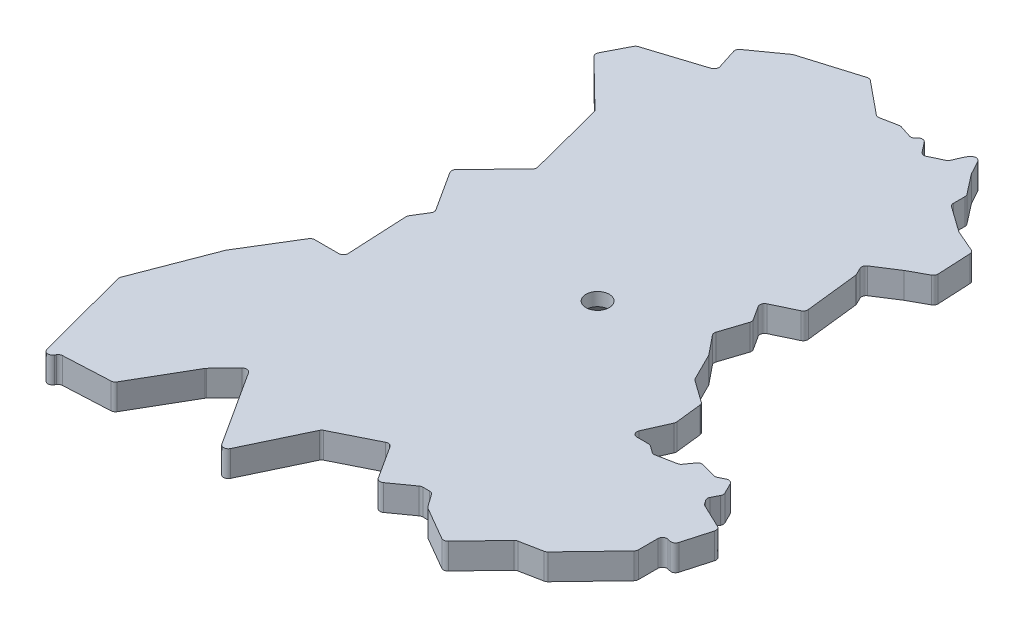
from build123d import *

# Parameters (mm, degrees)
BOSS_EXTRU_1_DEPTH                             = 5
CONG_1_R                                       = 0.9
FRAISAGE_POUR_VIS_T_TE_FRAIS_E_M41_D           = 4.5
FRAISAGE_POUR_VIS_T_TE_FRAIS_E_M41_CSINK_D     = 9.4
FRAISAGE_POUR_VIS_T_TE_FRAIS_E_M41_CSINK_ANGLE = 90


with BuildPart() as part:
    # Esquisse1 → Boss.-Extru.1 (new body)
    with BuildSketch(Plane(origin=(0, 0, 0), x_dir=(1, 0, 0), z_dir=(0, 1, 0))):
        Polygon((-10.941540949, 63.595080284), (-3.869711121, 57.820477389), (-1.4e-08, 58.580973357), (3.103081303, 57.567229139), (4.306471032, 59.040952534), (6.916683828, 55.681362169), (10.434006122, 57.36116315), (11.446720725, 59.704243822), (12.735497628, 61.282536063), (14.886637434, 57.361157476), (18.042910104, 53.298736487), (18.042910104, 50.268036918), (23.371023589, 46.477061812), (28.063351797, 44.448967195), (28.436769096, 36.88064725), (24.512113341, 34.727709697), (19.570725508, 31.543548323), (20.629835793, 29.32588548), (21.877892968, 18.292312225), (15.903639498, 15.43913131), (18.412210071, 11.546169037), (16.51950147, 5.752568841), (19.827055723, 1.662517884), (22.53475173, -3.766878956), (27.282822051, -7.145150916), (27.925841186, -12.829825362), (25.204278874, -18.989519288), (29.120202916, -18.989519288), (30.963004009, -20.30068), (35.327090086, -19.443026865), (37.026597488, -17.05441495), (40.777967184, -18.11659875), (43.038681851, -16.98915711), (44.666712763, -20.253639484), (43.511092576, -22.49265868), (44.463228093, -23.826183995), (50.011893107, -26.467164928), (48.043189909, -33.420136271), (45.60437309, -32.805860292), (45.60437309, -38.073751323), (37.026597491, -47.018586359), (32.201713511, -47.96679792), (25.300087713, -55.163757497), (18.173278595, -51.030962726), (16.053748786, -48.062428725), (13.982492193, -48.062428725), (8.966137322, -51.644100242), (3.901886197, -43.785067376), (-5.100561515, -48.274680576), (-11.471029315, -61.658946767), (-22.343400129, -44.786497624), (-26.600291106, -49.140124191), (-33.13222156, -60.404129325), (-43.079791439, -60.894937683), (-44.557952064, -63.443955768), (-50.161231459, -42.371676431), (-44.434407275, -27.444308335), (-38.106006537, -17.083630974), (-32.000560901, -17.083630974), (-32.636404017, -4.19653616), (-30.585474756, -0.838813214), (-36.172036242, 7.830774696), (-28.059737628, 16.127420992), (-32.047740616, 31.54354832), (-41.759480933, 41.039498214), (-38.989462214, 46.406421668), (-27.123913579, 50.193310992), (-28.828445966, 55.534162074), (-22.391334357, 60.130252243), align=None)
    extrude(amount=BOSS_EXTRU_1_DEPTH)

    # Cong_1
    cong_1_edges = [part.edges().sort_by_distance(p)[0] for p in [
        (48.043189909, 2.5, 33.420136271),
        (45.60437309, 2.5, 32.805860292),
        (45.60437309, 2.5, 38.073751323),
        (37.026597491, 2.5, 47.018586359),
        (32.201713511, 2.5, 47.96679792),
        (25.300087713, 2.5, 55.163757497),
        (18.173278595, 2.5, 51.030962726),
        (16.053748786, 2.5, 48.062428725),
        (13.982492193, 2.5, 48.062428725),
        (8.966137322, 2.5, 51.644100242),
        (3.901886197, 2.5, 43.785067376),
        (-5.100561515, 2.5, 48.274680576),
        (-11.471029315, 2.5, 61.658946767),
        (-22.343400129, 2.5, 44.786497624),
        (-26.600291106, 2.5, 49.140124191),
        (-33.13222156, 2.5, 60.404129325),
        (-43.079791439, 2.5, 60.894937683),
        (-44.557952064, 2.5, 63.443955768),
        (-50.161231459, 2.5, 42.371676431),
        (-44.434407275, 2.5, 27.444308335),
        (-38.106006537, 2.5, 17.083630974),
        (-32.000560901, 2.5, 17.083630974),
        (-32.636404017, 2.5, 4.19653616),
        (-30.585474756, 2.5, 0.838813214),
        (-36.172036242, 2.5, -7.830774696),
        (-28.059737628, 2.5, -16.127420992),
        (-32.047740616, 2.5, -31.54354832),
        (-41.759480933, 2.5, -41.039498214),
        (-38.989462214, 2.5, -46.406421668),
        (-27.123913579, 2.5, -50.193310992),
        (-28.828445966, 2.5, -55.534162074),
        (-22.391334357, 2.5, -60.130252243),
        (-10.941540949, 2.5, -63.595080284),
        (-3.869711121, 2.5, -57.820477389),
        (-1.4e-08, 2.5, -58.580973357),
        (3.103081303, 2.5, -57.567229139),
        (4.306471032, 2.5, -59.040952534),
        (6.916683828, 2.5, -55.681362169),
        (10.434006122, 2.5, -57.36116315),
        (11.446720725, 2.5, -59.704243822),
        (12.735497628, 2.5, -61.282536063),
        (14.886637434, 2.5, -57.361157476),
        (18.042910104, 2.5, -53.298736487),
        (18.042910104, 2.5, -50.268036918),
        (23.371023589, 2.5, -46.477061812),
        (28.063351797, 2.5, -44.448967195),
        (28.436769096, 2.5, -36.88064725),
        (19.570725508, 2.5, -31.543548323),
        (20.629835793, 2.5, -29.32588548),
        (21.877892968, 2.5, -18.292312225),
        (15.903639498, 2.5, -15.43913131),
        (18.412210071, 2.5, -11.546169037),
        (16.51950147, 2.5, -5.752568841),
        (19.827055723, 2.5, -1.662517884),
        (22.53475173, 2.5, 3.766878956),
        (27.282822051, 2.5, 7.145150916),
        (27.925841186, 2.5, 12.829825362),
        (25.204278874, 2.5, 18.989519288),
        (29.120202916, 2.5, 18.989519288),
        (30.963004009, 2.5, 20.30068),
        (35.327090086, 2.5, 19.443026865),
        (37.026597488, 2.5, 17.05441495),
        (40.777967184, 2.5, 18.11659875),
        (43.038681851, 2.5, 16.98915711),
        (44.666712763, 2.5, 20.253639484),
        (43.511092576, 2.5, 22.49265868),
        (44.463228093, 2.5, 23.826183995),
        (50.011893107, 2.5, 26.467164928),
    ]]
    fillet(cong_1_edges, radius=CONG_1_R)

    # Fraisage pour vis _ t_te frais_e M41 (through all)
    with Locations(Plane(origin=(0, 0, 0), x_dir=(-1, 0, 0), z_dir=(0, -1, 0))):
        with Locations((0, 0)):
            CounterSinkHole(FRAISAGE_POUR_VIS_T_TE_FRAIS_E_M41_D / 2, FRAISAGE_POUR_VIS_T_TE_FRAIS_E_M41_CSINK_D / 2, counter_sink_angle=FRAISAGE_POUR_VIS_T_TE_FRAIS_E_M41_CSINK_ANGLE)


solid = part.part
